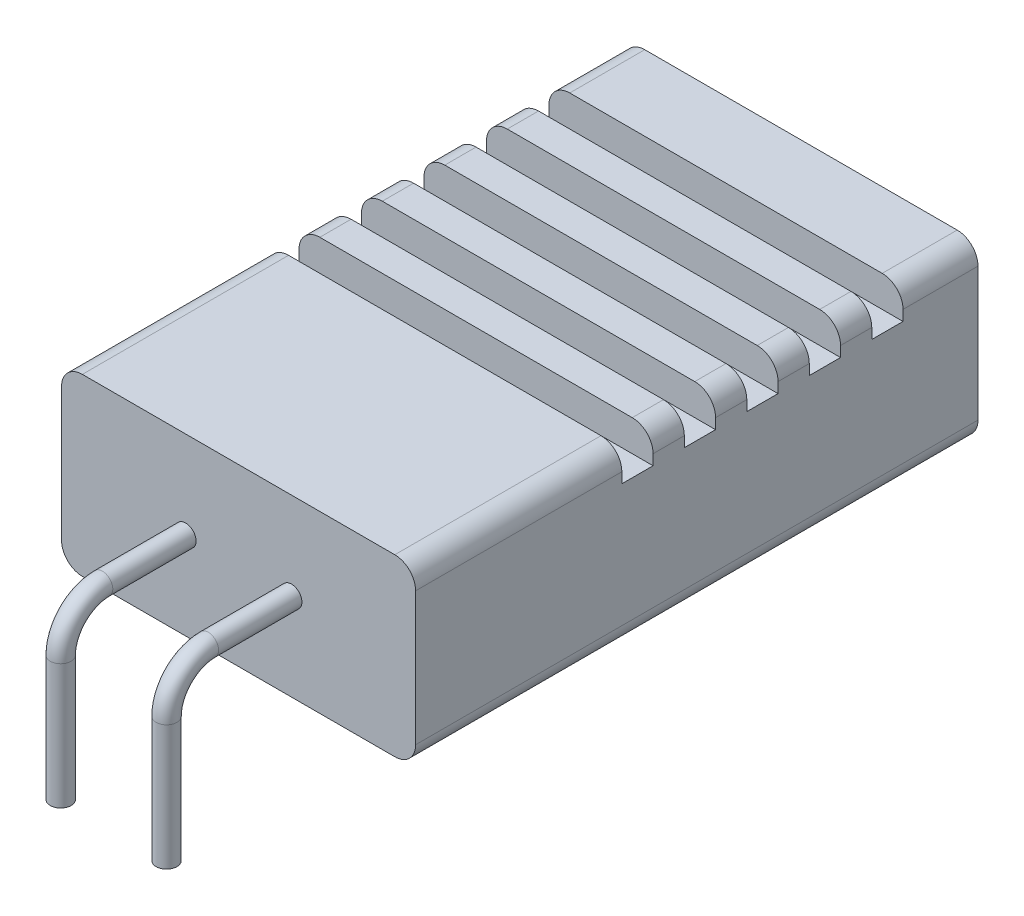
ISO-10303-21;
HEADER;
FILE_DESCRIPTION(('STEP AP214'),'2;1');
FILE_NAME('part.step','',(''),(''),'','','');
FILE_SCHEMA(('AUTOMOTIVE_DESIGN { 1 0 10303 214 1 1 1 1 }'));
ENDSEC;
DATA;
#1=APPLICATION_CONTEXT('core data for automotive mechanical design processes');
#2=APPLICATION_PROTOCOL_DEFINITION('international standard','automotive_design',2000,#1);
#3=PRODUCT_CONTEXT('',#1,'mechanical');
#4=PRODUCT('Part','Part','',(#3));
#5=PRODUCT_RELATED_PRODUCT_CATEGORY('part','',(#4));
#6=PRODUCT_DEFINITION_FORMATION('','',#4);
#7=PRODUCT_DEFINITION_CONTEXT('part definition',#1,'design');
#8=PRODUCT_DEFINITION('design','',#6,#7);
#9=PRODUCT_DEFINITION_SHAPE('','',#8);
#10=(LENGTH_UNIT() NAMED_UNIT(*) SI_UNIT(.MILLI.,.METRE.));
#11=(NAMED_UNIT(*) PLANE_ANGLE_UNIT() SI_UNIT($,.RADIAN.));
#12=(NAMED_UNIT(*) SI_UNIT($,.STERADIAN.) SOLID_ANGLE_UNIT());
#13=UNCERTAINTY_MEASURE_WITH_UNIT(LENGTH_MEASURE(1.E-05),#10,'distance_accuracy_value','');
#14=(GEOMETRIC_REPRESENTATION_CONTEXT(3) GLOBAL_UNCERTAINTY_ASSIGNED_CONTEXT((#13)) GLOBAL_UNIT_ASSIGNED_CONTEXT((#10,
#11,#12)) REPRESENTATION_CONTEXT('',''));
#15=CARTESIAN_POINT('',(0.,0.,0.));
#16=DIRECTION('',(0.,0.,1.));
#17=DIRECTION('',(1.,0.,0.));
#18=AXIS2_PLACEMENT_3D('',#15,#16,#17);
#19=CARTESIAN_POINT('',(0.,4.2,0.));
#20=DIRECTION('',(0.,0.,-1.));
#21=DIRECTION('',(-1.,0.,0.));
#22=AXIS2_PLACEMENT_3D('',#19,#20,#21);
#23=PLANE('',#22);
#24=CARTESIAN_POINT('',(5.52,2.1,0.));
#25=DIRECTION('',(0.,0.,1.));
#26=DIRECTION('',(1.,0.,0.));
#27=AXIS2_PLACEMENT_3D('',#24,#25,#26);
#28=CIRCLE('',#27,0.25);
#29=CARTESIAN_POINT('',(5.77,2.1,0.));
#30=VERTEX_POINT('',#29);
#31=EDGE_CURVE('E40',#30,#30,#28,.T.);
#32=ORIENTED_EDGE('',*,*,#31,.F.);
#33=EDGE_LOOP('',(#32));
#34=FACE_BOUND('',#33,.T.);
#35=DIRECTION('',(1.,0.,0.));
#36=VECTOR('',#35,1.);
#37=CARTESIAN_POINT('',(0.,0.,0.));
#38=LINE('',#37,#36);
#39=CARTESIAN_POINT('',(0.5,0.,0.));
#40=VERTEX_POINT('',#39);
#41=CARTESIAN_POINT('',(8.,0.,0.));
#42=VERTEX_POINT('',#41);
#43=EDGE_CURVE('E422',#40,#42,#38,.T.);
#44=ORIENTED_EDGE('',*,*,#43,.T.);
#45=CARTESIAN_POINT('',(8.,0.5,0.));
#46=DIRECTION('',(0.,0.,-1.));
#47=DIRECTION('',(-1.,0.,0.));
#48=AXIS2_PLACEMENT_3D('',#45,#46,#47);
#49=CIRCLE('',#48,0.5);
#50=CARTESIAN_POINT('',(8.5,0.5,0.));
#51=VERTEX_POINT('',#50);
#52=EDGE_CURVE('E484',#42,#51,#49,.F.);
#53=ORIENTED_EDGE('',*,*,#52,.T.);
#54=DIRECTION('',(0.,-1.,0.));
#55=VECTOR('',#54,1.);
#56=CARTESIAN_POINT('',(8.5,4.2,0.));
#57=LINE('',#56,#55);
#58=CARTESIAN_POINT('',(8.5,3.7,0.));
#59=VERTEX_POINT('',#58);
#60=EDGE_CURVE('E447',#59,#51,#57,.T.);
#61=ORIENTED_EDGE('',*,*,#60,.F.);
#62=CARTESIAN_POINT('',(8.,3.7,0.));
#63=DIRECTION('',(0.,0.,-1.));
#64=DIRECTION('',(-1.,0.,0.));
#65=AXIS2_PLACEMENT_3D('',#62,#63,#64);
#66=CIRCLE('',#65,0.5);
#67=CARTESIAN_POINT('',(8.,4.2,0.));
#68=VERTEX_POINT('',#67);
#69=EDGE_CURVE('E480',#59,#68,#66,.F.);
#70=ORIENTED_EDGE('',*,*,#69,.T.);
#71=DIRECTION('',(1.,0.,0.));
#72=VECTOR('',#71,1.);
#73=CARTESIAN_POINT('',(0.,4.2,0.));
#74=LINE('',#73,#72);
#75=CARTESIAN_POINT('',(0.5,4.2,0.));
#76=VERTEX_POINT('',#75);
#77=EDGE_CURVE('E430',#76,#68,#74,.T.);
#78=ORIENTED_EDGE('',*,*,#77,.F.);
#79=CARTESIAN_POINT('',(0.5,3.7,0.));
#80=DIRECTION('',(0.,0.,-1.));
#81=DIRECTION('',(-1.,0.,0.));
#82=AXIS2_PLACEMENT_3D('',#79,#80,#81);
#83=CIRCLE('',#82,0.5);
#84=CARTESIAN_POINT('',(0.,3.7,0.));
#85=VERTEX_POINT('',#84);
#86=EDGE_CURVE('E478',#76,#85,#83,.F.);
#87=ORIENTED_EDGE('',*,*,#86,.T.);
#88=DIRECTION('',(0.,-1.,0.));
#89=VECTOR('',#88,1.);
#90=CARTESIAN_POINT('',(0.,4.2,0.));
#91=LINE('',#90,#89);
#92=CARTESIAN_POINT('',(0.,0.5,0.));
#93=VERTEX_POINT('',#92);
#94=EDGE_CURVE('E449',#85,#93,#91,.T.);
#95=ORIENTED_EDGE('',*,*,#94,.T.);
#96=CARTESIAN_POINT('',(0.5,0.5,0.));
#97=DIRECTION('',(0.,0.,-1.));
#98=DIRECTION('',(-1.,0.,0.));
#99=AXIS2_PLACEMENT_3D('',#96,#97,#98);
#100=CIRCLE('',#99,0.5);
#101=EDGE_CURVE('E482',#93,#40,#100,.F.);
#102=ORIENTED_EDGE('',*,*,#101,.T.);
#103=EDGE_LOOP('',(#44,#53,#61,#70,#78,#87,#95,#102));
#104=FACE_BOUND('',#103,.T.);
#105=CARTESIAN_POINT('',(2.98,2.1,0.));
#106=DIRECTION('',(0.,0.,1.));
#107=DIRECTION('',(-1.,0.,0.));
#108=AXIS2_PLACEMENT_3D('',#105,#106,#107);
#109=CIRCLE('',#108,0.25);
#110=CARTESIAN_POINT('',(2.73,2.1,0.));
#111=VERTEX_POINT('',#110);
#112=EDGE_CURVE('E11',#111,#111,#109,.T.);
#113=ORIENTED_EDGE('',*,*,#112,.F.);
#114=EDGE_LOOP('',(#113));
#115=FACE_BOUND('',#114,.T.);
#116=ADVANCED_FACE('F31',(#34,#104,#115),#23,.F.);
#117=CARTESIAN_POINT('',(0.,4.2,-13.5));
#118=DIRECTION('',(0.,-1.,0.));
#119=DIRECTION('',(0.,0.,-1.));
#120=AXIS2_PLACEMENT_3D('',#117,#118,#119);
#121=PLANE('',#120);
#122=DIRECTION('',(-1.,0.,0.));
#123=VECTOR('',#122,1.);
#124=CARTESIAN_POINT('',(8.5,4.2,-5.7));
#125=LINE('',#124,#123);
#126=CARTESIAN_POINT('',(8.,4.2,-5.7));
#127=VERTEX_POINT('',#126);
#128=CARTESIAN_POINT('',(0.5,4.2,-5.7));
#129=VERTEX_POINT('',#128);
#130=EDGE_CURVE('E316',#127,#129,#125,.T.);
#131=ORIENTED_EDGE('',*,*,#130,.F.);
#132=DIRECTION('',(0.,0.,-1.));
#133=VECTOR('',#132,1.);
#134=CARTESIAN_POINT('',(8.,4.2,-13.5));
#135=LINE('',#134,#133);
#136=CARTESIAN_POINT('',(8.,4.2,-6.45));
#137=VERTEX_POINT('',#136);
#138=EDGE_CURVE('E556',#127,#137,#135,.T.);
#139=ORIENTED_EDGE('',*,*,#138,.T.);
#140=DIRECTION('',(-1.,0.,0.));
#141=VECTOR('',#140,1.);
#142=CARTESIAN_POINT('',(8.5,4.2,-6.45));
#143=LINE('',#142,#141);
#144=CARTESIAN_POINT('',(0.5,4.2,-6.45));
#145=VERTEX_POINT('',#144);
#146=EDGE_CURVE('E342',#137,#145,#143,.T.);
#147=ORIENTED_EDGE('',*,*,#146,.T.);
#148=DIRECTION('',(0.,0.,1.));
#149=VECTOR('',#148,1.);
#150=CARTESIAN_POINT('',(0.5,4.2,-13.5));
#151=LINE('',#150,#149);
#152=EDGE_CURVE('E553',#145,#129,#151,.T.);
#153=ORIENTED_EDGE('',*,*,#152,.T.);
#154=EDGE_LOOP('',(#131,#139,#147,#153));
#155=FACE_BOUND('',#154,.T.);
#156=ADVANCED_FACE('F602',(#155),#121,.F.);
#157=DIRECTION('',(-1.,0.,0.));
#158=VECTOR('',#157,1.);
#159=CARTESIAN_POINT('',(8.5,4.2,-7.2));
#160=LINE('',#159,#158);
#161=CARTESIAN_POINT('',(8.,4.2,-7.2));
#162=VERTEX_POINT('',#161);
#163=CARTESIAN_POINT('',(0.5,4.2,-7.2));
#164=VERTEX_POINT('',#163);
#165=EDGE_CURVE('E338',#162,#164,#160,.T.);
#166=ORIENTED_EDGE('',*,*,#165,.F.);
#167=DIRECTION('',(0.,0.,-1.));
#168=VECTOR('',#167,1.);
#169=CARTESIAN_POINT('',(8.,4.2,-13.5));
#170=LINE('',#169,#168);
#171=CARTESIAN_POINT('',(8.,4.2,-7.95));
#172=VERTEX_POINT('',#171);
#173=EDGE_CURVE('E542',#162,#172,#170,.T.);
#174=ORIENTED_EDGE('',*,*,#173,.T.);
#175=DIRECTION('',(-1.,0.,0.));
#176=VECTOR('',#175,1.);
#177=CARTESIAN_POINT('',(8.5,4.2,-7.95));
#178=LINE('',#177,#176);
#179=CARTESIAN_POINT('',(0.5,4.2,-7.95));
#180=VERTEX_POINT('',#179);
#181=EDGE_CURVE('E369',#172,#180,#178,.T.);
#182=ORIENTED_EDGE('',*,*,#181,.T.);
#183=DIRECTION('',(0.,0.,1.));
#184=VECTOR('',#183,1.);
#185=CARTESIAN_POINT('',(0.5,4.2,-13.5));
#186=LINE('',#185,#184);
#187=EDGE_CURVE('E539',#180,#164,#186,.T.);
#188=ORIENTED_EDGE('',*,*,#187,.T.);
#189=EDGE_LOOP('',(#166,#174,#182,#188));
#190=FACE_BOUND('',#189,.T.);
#191=ADVANCED_FACE('F608',(#190),#121,.F.);
#192=DIRECTION('',(-1.,0.,0.));
#193=VECTOR('',#192,1.);
#194=CARTESIAN_POINT('',(8.5,4.2,-8.7));
#195=LINE('',#194,#193);
#196=CARTESIAN_POINT('',(8.,4.2,-8.7));
#197=VERTEX_POINT('',#196);
#198=CARTESIAN_POINT('',(0.5,4.2,-8.7));
#199=VERTEX_POINT('',#198);
#200=EDGE_CURVE('E365',#197,#199,#195,.T.);
#201=ORIENTED_EDGE('',*,*,#200,.F.);
#202=DIRECTION('',(0.,0.,-1.));
#203=VECTOR('',#202,1.);
#204=CARTESIAN_POINT('',(8.,4.2,-13.5));
#205=LINE('',#204,#203);
#206=CARTESIAN_POINT('',(8.,4.2,-9.45));
#207=VERTEX_POINT('',#206);
#208=EDGE_CURVE('E528',#197,#207,#205,.T.);
#209=ORIENTED_EDGE('',*,*,#208,.T.);
#210=DIRECTION('',(-1.,0.,0.));
#211=VECTOR('',#210,1.);
#212=CARTESIAN_POINT('',(8.5,4.2,-9.45));
#213=LINE('',#212,#211);
#214=CARTESIAN_POINT('',(0.5,4.2,-9.45));
#215=VERTEX_POINT('',#214);
#216=EDGE_CURVE('E396',#207,#215,#213,.T.);
#217=ORIENTED_EDGE('',*,*,#216,.T.);
#218=DIRECTION('',(0.,0.,1.));
#219=VECTOR('',#218,1.);
#220=CARTESIAN_POINT('',(0.5,4.2,-13.5));
#221=LINE('',#220,#219);
#222=EDGE_CURVE('E525',#215,#199,#221,.T.);
#223=ORIENTED_EDGE('',*,*,#222,.T.);
#224=EDGE_LOOP('',(#201,#209,#217,#223));
#225=FACE_BOUND('',#224,.T.);
#226=ADVANCED_FACE('F713',(#225),#121,.F.);
#227=DIRECTION('',(-1.,0.,0.));
#228=VECTOR('',#227,1.);
#229=CARTESIAN_POINT('',(8.5,4.2,-10.2));
#230=LINE('',#229,#228);
#231=CARTESIAN_POINT('',(8.,4.2,-10.2));
#232=VERTEX_POINT('',#231);
#233=CARTESIAN_POINT('',(0.5,4.2,-10.2));
#234=VERTEX_POINT('',#233);
#235=EDGE_CURVE('E392',#232,#234,#230,.T.);
#236=ORIENTED_EDGE('',*,*,#235,.F.);
#237=DIRECTION('',(0.,0.,-1.));
#238=VECTOR('',#237,1.);
#239=CARTESIAN_POINT('',(8.,4.2,-13.5));
#240=LINE('',#239,#238);
#241=CARTESIAN_POINT('',(8.,4.2,-10.95));
#242=VERTEX_POINT('',#241);
#243=EDGE_CURVE('E514',#232,#242,#240,.T.);
#244=ORIENTED_EDGE('',*,*,#243,.T.);
#245=DIRECTION('',(-1.,0.,0.));
#246=VECTOR('',#245,1.);
#247=CARTESIAN_POINT('',(8.5,4.2,-10.95));
#248=LINE('',#247,#246);
#249=CARTESIAN_POINT('',(0.5,4.2,-10.95));
#250=VERTEX_POINT('',#249);
#251=EDGE_CURVE('E423',#242,#250,#248,.T.);
#252=ORIENTED_EDGE('',*,*,#251,.T.);
#253=DIRECTION('',(0.,0.,1.));
#254=VECTOR('',#253,1.);
#255=CARTESIAN_POINT('',(0.5,4.2,-13.5));
#256=LINE('',#255,#254);
#257=EDGE_CURVE('E511',#250,#234,#256,.T.);
#258=ORIENTED_EDGE('',*,*,#257,.T.);
#259=EDGE_LOOP('',(#236,#244,#252,#258));
#260=FACE_BOUND('',#259,.T.);
#261=ADVANCED_FACE('F680',(#260),#121,.F.);
#262=DIRECTION('',(-1.,0.,0.));
#263=VECTOR('',#262,1.);
#264=CARTESIAN_POINT('',(8.5,4.2,-11.7));
#265=LINE('',#264,#263);
#266=CARTESIAN_POINT('',(8.,4.2,-11.7));
#267=VERTEX_POINT('',#266);
#268=CARTESIAN_POINT('',(0.5,4.2,-11.7));
#269=VERTEX_POINT('',#268);
#270=EDGE_CURVE('E419',#267,#269,#265,.T.);
#271=ORIENTED_EDGE('',*,*,#270,.F.);
#272=DIRECTION('',(0.,0.,-1.));
#273=VECTOR('',#272,1.);
#274=CARTESIAN_POINT('',(8.,4.2,-13.5));
#275=LINE('',#274,#273);
#276=CARTESIAN_POINT('',(8.,4.2,-13.5));
#277=VERTEX_POINT('',#276);
#278=EDGE_CURVE('E504',#267,#277,#275,.T.);
#279=ORIENTED_EDGE('',*,*,#278,.T.);
#280=DIRECTION('',(-1.,0.,0.));
#281=VECTOR('',#280,1.);
#282=CARTESIAN_POINT('',(0.,4.2,-13.5));
#283=LINE('',#282,#281);
#284=CARTESIAN_POINT('',(0.5,4.2,-13.5));
#285=VERTEX_POINT('',#284);
#286=EDGE_CURVE('E433',#277,#285,#283,.T.);
#287=ORIENTED_EDGE('',*,*,#286,.T.);
#288=DIRECTION('',(0.,0.,1.));
#289=VECTOR('',#288,1.);
#290=CARTESIAN_POINT('',(0.5,4.2,-13.5));
#291=LINE('',#290,#289);
#292=EDGE_CURVE('E501',#285,#269,#291,.T.);
#293=ORIENTED_EDGE('',*,*,#292,.T.);
#294=EDGE_LOOP('',(#271,#279,#287,#293));
#295=FACE_BOUND('',#294,.T.);
#296=ADVANCED_FACE('F619',(#295),#121,.F.);
#297=CARTESIAN_POINT('',(0.,4.2,0.));
#298=DIRECTION('',(1.,0.,0.));
#299=DIRECTION('',(0.,0.,-1.));
#300=AXIS2_PLACEMENT_3D('',#297,#298,#299);
#301=PLANE('',#300);
#302=DIRECTION('',(0.,-1.,0.));
#303=VECTOR('',#302,1.);
#304=CARTESIAN_POINT('',(0.,4.2,-13.5));
#305=LINE('',#304,#303);
#306=CARTESIAN_POINT('',(0.,3.7,-13.5));
#307=VERTEX_POINT('',#306);
#308=CARTESIAN_POINT('',(0.,0.5,-13.5));
#309=VERTEX_POINT('',#308);
#310=EDGE_CURVE('E437',#307,#309,#305,.T.);
#311=ORIENTED_EDGE('',*,*,#310,.T.);
#312=DIRECTION('',(0.,0.,1.));
#313=VECTOR('',#312,1.);
#314=CARTESIAN_POINT('',(0.,0.5,0.));
#315=LINE('',#314,#313);
#316=EDGE_CURVE('E498',#309,#93,#315,.T.);
#317=ORIENTED_EDGE('',*,*,#316,.T.);
#318=ORIENTED_EDGE('',*,*,#94,.F.);
#319=DIRECTION('',(0.,0.,1.));
#320=VECTOR('',#319,1.);
#321=CARTESIAN_POINT('',(0.,3.7,0.));
#322=LINE('',#321,#320);
#323=CARTESIAN_POINT('',(0.,3.7,-4.95));
#324=VERTEX_POINT('',#323);
#325=EDGE_CURVE('E496',#85,#324,#322,.F.);
#326=ORIENTED_EDGE('',*,*,#325,.T.);
#327=DIRECTION('',(0.,1.,0.));
#328=VECTOR('',#327,1.);
#329=CARTESIAN_POINT('',(0.,3.45,-4.95));
#330=LINE('',#329,#328);
#331=CARTESIAN_POINT('',(0.,3.45,-4.95));
#332=VERTEX_POINT('',#331);
#333=EDGE_CURVE('E292',#332,#324,#330,.T.);
#334=ORIENTED_EDGE('',*,*,#333,.F.);
#335=DIRECTION('',(0.,0.,1.));
#336=VECTOR('',#335,1.);
#337=CARTESIAN_POINT('',(0.,3.45,-5.7));
#338=LINE('',#337,#336);
#339=CARTESIAN_POINT('',(0.,3.45,-5.7));
#340=VERTEX_POINT('',#339);
#341=EDGE_CURVE('E312',#340,#332,#338,.T.);
#342=ORIENTED_EDGE('',*,*,#341,.F.);
#343=DIRECTION('',(0.,-1.,0.));
#344=VECTOR('',#343,1.);
#345=CARTESIAN_POINT('',(0.,3.45,-5.7));
#346=LINE('',#345,#344);
#347=CARTESIAN_POINT('',(0.,3.7,-5.7));
#348=VERTEX_POINT('',#347);
#349=EDGE_CURVE('E298',#348,#340,#346,.T.);
#350=ORIENTED_EDGE('',*,*,#349,.F.);
#351=DIRECTION('',(0.,0.,1.));
#352=VECTOR('',#351,1.);
#353=CARTESIAN_POINT('',(0.,3.7,0.));
#354=LINE('',#353,#352);
#355=CARTESIAN_POINT('',(0.,3.7,-6.45));
#356=VERTEX_POINT('',#355);
#357=EDGE_CURVE('E494',#348,#356,#354,.F.);
#358=ORIENTED_EDGE('',*,*,#357,.T.);
#359=DIRECTION('',(0.,1.,0.));
#360=VECTOR('',#359,1.);
#361=CARTESIAN_POINT('',(0.,3.45,-6.45));
#362=LINE('',#361,#360);
#363=CARTESIAN_POINT('',(0.,3.45,-6.45));
#364=VERTEX_POINT('',#363);
#365=EDGE_CURVE('E326',#364,#356,#362,.T.);
#366=ORIENTED_EDGE('',*,*,#365,.F.);
#367=DIRECTION('',(0.,0.,1.));
#368=VECTOR('',#367,1.);
#369=CARTESIAN_POINT('',(0.,3.45,-7.2));
#370=LINE('',#369,#368);
#371=CARTESIAN_POINT('',(0.,3.45,-7.2));
#372=VERTEX_POINT('',#371);
#373=EDGE_CURVE('E333',#372,#364,#370,.T.);
#374=ORIENTED_EDGE('',*,*,#373,.F.);
#375=DIRECTION('',(0.,-1.,0.));
#376=VECTOR('',#375,1.);
#377=CARTESIAN_POINT('',(0.,3.45,-7.2));
#378=LINE('',#377,#376);
#379=CARTESIAN_POINT('',(0.,3.7,-7.2));
#380=VERTEX_POINT('',#379);
#381=EDGE_CURVE('E319',#380,#372,#378,.T.);
#382=ORIENTED_EDGE('',*,*,#381,.F.);
#383=DIRECTION('',(0.,0.,1.));
#384=VECTOR('',#383,1.);
#385=CARTESIAN_POINT('',(0.,3.7,0.));
#386=LINE('',#385,#384);
#387=CARTESIAN_POINT('',(0.,3.7,-7.95));
#388=VERTEX_POINT('',#387);
#389=EDGE_CURVE('E492',#380,#388,#386,.F.);
#390=ORIENTED_EDGE('',*,*,#389,.T.);
#391=DIRECTION('',(0.,1.,0.));
#392=VECTOR('',#391,1.);
#393=CARTESIAN_POINT('',(0.,3.45,-7.95));
#394=LINE('',#393,#392);
#395=CARTESIAN_POINT('',(0.,3.45,-7.95));
#396=VERTEX_POINT('',#395);
#397=EDGE_CURVE('E352',#396,#388,#394,.T.);
#398=ORIENTED_EDGE('',*,*,#397,.F.);
#399=DIRECTION('',(0.,0.,1.));
#400=VECTOR('',#399,1.);
#401=CARTESIAN_POINT('',(0.,3.45,-8.7));
#402=LINE('',#401,#400);
#403=CARTESIAN_POINT('',(0.,3.45,-8.7));
#404=VERTEX_POINT('',#403);
#405=EDGE_CURVE('E360',#404,#396,#402,.T.);
#406=ORIENTED_EDGE('',*,*,#405,.F.);
#407=DIRECTION('',(0.,-1.,0.));
#408=VECTOR('',#407,1.);
#409=CARTESIAN_POINT('',(0.,3.45,-8.7));
#410=LINE('',#409,#408);
#411=CARTESIAN_POINT('',(0.,3.7,-8.7));
#412=VERTEX_POINT('',#411);
#413=EDGE_CURVE('E341',#412,#404,#410,.T.);
#414=ORIENTED_EDGE('',*,*,#413,.F.);
#415=DIRECTION('',(0.,0.,1.));
#416=VECTOR('',#415,1.);
#417=CARTESIAN_POINT('',(0.,3.7,0.));
#418=LINE('',#417,#416);
#419=CARTESIAN_POINT('',(0.,3.7,-9.45));
#420=VERTEX_POINT('',#419);
#421=EDGE_CURVE('E490',#412,#420,#418,.F.);
#422=ORIENTED_EDGE('',*,*,#421,.T.);
#423=DIRECTION('',(0.,1.,0.));
#424=VECTOR('',#423,1.);
#425=CARTESIAN_POINT('',(0.,3.45,-9.45));
#426=LINE('',#425,#424);
#427=CARTESIAN_POINT('',(0.,3.45,-9.45));
#428=VERTEX_POINT('',#427);
#429=EDGE_CURVE('E379',#428,#420,#426,.T.);
#430=ORIENTED_EDGE('',*,*,#429,.F.);
#431=DIRECTION('',(0.,0.,1.));
#432=VECTOR('',#431,1.);
#433=CARTESIAN_POINT('',(0.,3.45,-10.2));
#434=LINE('',#433,#432);
#435=CARTESIAN_POINT('',(0.,3.45,-10.2));
#436=VERTEX_POINT('',#435);
#437=EDGE_CURVE('E387',#436,#428,#434,.T.);
#438=ORIENTED_EDGE('',*,*,#437,.F.);
#439=DIRECTION('',(0.,-1.,0.));
#440=VECTOR('',#439,1.);
#441=CARTESIAN_POINT('',(0.,3.45,-10.2));
#442=LINE('',#441,#440);
#443=CARTESIAN_POINT('',(0.,3.7,-10.2));
#444=VERTEX_POINT('',#443);
#445=EDGE_CURVE('E368',#444,#436,#442,.T.);
#446=ORIENTED_EDGE('',*,*,#445,.F.);
#447=DIRECTION('',(0.,0.,1.));
#448=VECTOR('',#447,1.);
#449=CARTESIAN_POINT('',(0.,3.7,0.));
#450=LINE('',#449,#448);
#451=CARTESIAN_POINT('',(0.,3.7,-10.95));
#452=VERTEX_POINT('',#451);
#453=EDGE_CURVE('E488',#444,#452,#450,.F.);
#454=ORIENTED_EDGE('',*,*,#453,.T.);
#455=DIRECTION('',(0.,1.,0.));
#456=VECTOR('',#455,1.);
#457=CARTESIAN_POINT('',(0.,3.45,-10.95));
#458=LINE('',#457,#456);
#459=CARTESIAN_POINT('',(0.,3.45,-10.95));
#460=VERTEX_POINT('',#459);
#461=EDGE_CURVE('E406',#460,#452,#458,.T.);
#462=ORIENTED_EDGE('',*,*,#461,.F.);
#463=DIRECTION('',(0.,0.,1.));
#464=VECTOR('',#463,1.);
#465=CARTESIAN_POINT('',(0.,3.45,-11.7));
#466=LINE('',#465,#464);
#467=CARTESIAN_POINT('',(0.,3.45,-11.7));
#468=VERTEX_POINT('',#467);
#469=EDGE_CURVE('E414',#468,#460,#466,.T.);
#470=ORIENTED_EDGE('',*,*,#469,.F.);
#471=DIRECTION('',(0.,-1.,0.));
#472=VECTOR('',#471,1.);
#473=CARTESIAN_POINT('',(0.,3.45,-11.7));
#474=LINE('',#473,#472);
#475=CARTESIAN_POINT('',(0.,3.7,-11.7));
#476=VERTEX_POINT('',#475);
#477=EDGE_CURVE('E395',#476,#468,#474,.T.);
#478=ORIENTED_EDGE('',*,*,#477,.F.);
#479=DIRECTION('',(0.,0.,1.));
#480=VECTOR('',#479,1.);
#481=CARTESIAN_POINT('',(0.,3.7,0.));
#482=LINE('',#481,#480);
#483=EDGE_CURVE('E486',#476,#307,#482,.F.);
#484=ORIENTED_EDGE('',*,*,#483,.T.);
#485=EDGE_LOOP('',(#311,#317,#318,#326,#334,#342,#350,#358,#366,#374,#382,#390,#398,#406,#414,
#422,#430,#438,#446,#454,#462,#470,#478,#484));
#486=FACE_BOUND('',#485,.T.);
#487=ADVANCED_FACE('F616',(#486),#301,.F.);
#488=CARTESIAN_POINT('',(8.5,4.2,0.));
#489=DIRECTION('',(-1.,0.,0.));
#490=DIRECTION('',(0.,0.,1.));
#491=AXIS2_PLACEMENT_3D('',#488,#489,#490);
#492=PLANE('',#491);
#493=ORIENTED_EDGE('',*,*,#60,.T.);
#494=DIRECTION('',(0.,0.,-1.));
#495=VECTOR('',#494,1.);
#496=CARTESIAN_POINT('',(8.5,0.5,-13.5));
#497=LINE('',#496,#495);
#498=CARTESIAN_POINT('',(8.5,0.5,-13.5));
#499=VERTEX_POINT('',#498);
#500=EDGE_CURVE('E463',#51,#499,#497,.T.);
#501=ORIENTED_EDGE('',*,*,#500,.T.);
#502=DIRECTION('',(0.,-1.,0.));
#503=VECTOR('',#502,1.);
#504=CARTESIAN_POINT('',(8.5,4.2,-13.5));
#505=LINE('',#504,#503);
#506=CARTESIAN_POINT('',(8.5,3.7,-13.5));
#507=VERTEX_POINT('',#506);
#508=EDGE_CURVE('E444',#507,#499,#505,.T.);
#509=ORIENTED_EDGE('',*,*,#508,.F.);
#510=DIRECTION('',(0.,0.,-1.));
#511=VECTOR('',#510,1.);
#512=CARTESIAN_POINT('',(8.5,3.7,0.));
#513=LINE('',#512,#511);
#514=CARTESIAN_POINT('',(8.5,3.7,-11.7));
#515=VERTEX_POINT('',#514);
#516=EDGE_CURVE('E461',#507,#515,#513,.F.);
#517=ORIENTED_EDGE('',*,*,#516,.T.);
#518=DIRECTION('',(0.,-1.,0.));
#519=VECTOR('',#518,1.);
#520=CARTESIAN_POINT('',(8.5,3.45,-11.7));
#521=LINE('',#520,#519);
#522=CARTESIAN_POINT('',(8.5,3.45,-11.7));
#523=VERTEX_POINT('',#522);
#524=EDGE_CURVE('E403',#515,#523,#521,.T.);
#525=ORIENTED_EDGE('',*,*,#524,.T.);
#526=DIRECTION('',(0.,0.,1.));
#527=VECTOR('',#526,1.);
#528=CARTESIAN_POINT('',(8.5,3.45,-11.7));
#529=LINE('',#528,#527);
#530=CARTESIAN_POINT('',(8.5,3.45,-10.95));
#531=VERTEX_POINT('',#530);
#532=EDGE_CURVE('E405',#523,#531,#529,.T.);
#533=ORIENTED_EDGE('',*,*,#532,.T.);
#534=DIRECTION('',(0.,1.,0.));
#535=VECTOR('',#534,1.);
#536=CARTESIAN_POINT('',(8.5,3.45,-10.95));
#537=LINE('',#536,#535);
#538=CARTESIAN_POINT('',(8.5,3.7,-10.95));
#539=VERTEX_POINT('',#538);
#540=EDGE_CURVE('E409',#531,#539,#537,.T.);
#541=ORIENTED_EDGE('',*,*,#540,.T.);
#542=DIRECTION('',(0.,0.,-1.));
#543=VECTOR('',#542,1.);
#544=CARTESIAN_POINT('',(8.5,3.7,0.));
#545=LINE('',#544,#543);
#546=CARTESIAN_POINT('',(8.5,3.7,-10.2));
#547=VERTEX_POINT('',#546);
#548=EDGE_CURVE('E459',#539,#547,#545,.F.);
#549=ORIENTED_EDGE('',*,*,#548,.T.);
#550=DIRECTION('',(0.,-1.,0.));
#551=VECTOR('',#550,1.);
#552=CARTESIAN_POINT('',(8.5,3.45,-10.2));
#553=LINE('',#552,#551);
#554=CARTESIAN_POINT('',(8.5,3.45,-10.2));
#555=VERTEX_POINT('',#554);
#556=EDGE_CURVE('E376',#547,#555,#553,.T.);
#557=ORIENTED_EDGE('',*,*,#556,.T.);
#558=DIRECTION('',(0.,0.,1.));
#559=VECTOR('',#558,1.);
#560=CARTESIAN_POINT('',(8.5,3.45,-10.2));
#561=LINE('',#560,#559);
#562=CARTESIAN_POINT('',(8.5,3.45,-9.45));
#563=VERTEX_POINT('',#562);
#564=EDGE_CURVE('E378',#555,#563,#561,.T.);
#565=ORIENTED_EDGE('',*,*,#564,.T.);
#566=DIRECTION('',(0.,1.,0.));
#567=VECTOR('',#566,1.);
#568=CARTESIAN_POINT('',(8.5,3.45,-9.45));
#569=LINE('',#568,#567);
#570=CARTESIAN_POINT('',(8.5,3.7,-9.45));
#571=VERTEX_POINT('',#570);
#572=EDGE_CURVE('E382',#563,#571,#569,.T.);
#573=ORIENTED_EDGE('',*,*,#572,.T.);
#574=DIRECTION('',(0.,0.,-1.));
#575=VECTOR('',#574,1.);
#576=CARTESIAN_POINT('',(8.5,3.7,0.));
#577=LINE('',#576,#575);
#578=CARTESIAN_POINT('',(8.5,3.7,-8.7));
#579=VERTEX_POINT('',#578);
#580=EDGE_CURVE('E457',#571,#579,#577,.F.);
#581=ORIENTED_EDGE('',*,*,#580,.T.);
#582=DIRECTION('',(0.,-1.,0.));
#583=VECTOR('',#582,1.);
#584=CARTESIAN_POINT('',(8.5,3.45,-8.7));
#585=LINE('',#584,#583);
#586=CARTESIAN_POINT('',(8.5,3.45,-8.7));
#587=VERTEX_POINT('',#586);
#588=EDGE_CURVE('E349',#579,#587,#585,.T.);
#589=ORIENTED_EDGE('',*,*,#588,.T.);
#590=DIRECTION('',(0.,0.,1.));
#591=VECTOR('',#590,1.);
#592=CARTESIAN_POINT('',(8.5,3.45,-8.7));
#593=LINE('',#592,#591);
#594=CARTESIAN_POINT('',(8.5,3.45,-7.95));
#595=VERTEX_POINT('',#594);
#596=EDGE_CURVE('E351',#587,#595,#593,.T.);
#597=ORIENTED_EDGE('',*,*,#596,.T.);
#598=DIRECTION('',(0.,1.,0.));
#599=VECTOR('',#598,1.);
#600=CARTESIAN_POINT('',(8.5,3.45,-7.95));
#601=LINE('',#600,#599);
#602=CARTESIAN_POINT('',(8.5,3.7,-7.95));
#603=VERTEX_POINT('',#602);
#604=EDGE_CURVE('E355',#595,#603,#601,.T.);
#605=ORIENTED_EDGE('',*,*,#604,.T.);
#606=DIRECTION('',(0.,0.,-1.));
#607=VECTOR('',#606,1.);
#608=CARTESIAN_POINT('',(8.5,3.7,0.));
#609=LINE('',#608,#607);
#610=CARTESIAN_POINT('',(8.5,3.7,-7.2));
#611=VERTEX_POINT('',#610);
#612=EDGE_CURVE('E455',#603,#611,#609,.F.);
#613=ORIENTED_EDGE('',*,*,#612,.T.);
#614=DIRECTION('',(0.,-1.,0.));
#615=VECTOR('',#614,1.);
#616=CARTESIAN_POINT('',(8.5,3.45,-7.2));
#617=LINE('',#616,#615);
#618=CARTESIAN_POINT('',(8.5,3.45,-7.2));
#619=VERTEX_POINT('',#618);
#620=EDGE_CURVE('E323',#611,#619,#617,.T.);
#621=ORIENTED_EDGE('',*,*,#620,.T.);
#622=DIRECTION('',(0.,0.,1.));
#623=VECTOR('',#622,1.);
#624=CARTESIAN_POINT('',(8.5,3.45,-7.2));
#625=LINE('',#624,#623);
#626=CARTESIAN_POINT('',(8.5,3.45,-6.45));
#627=VERTEX_POINT('',#626);
#628=EDGE_CURVE('E325',#619,#627,#625,.T.);
#629=ORIENTED_EDGE('',*,*,#628,.T.);
#630=DIRECTION('',(0.,1.,0.));
#631=VECTOR('',#630,1.);
#632=CARTESIAN_POINT('',(8.5,3.45,-6.45));
#633=LINE('',#632,#631);
#634=CARTESIAN_POINT('',(8.5,3.7,-6.45));
#635=VERTEX_POINT('',#634);
#636=EDGE_CURVE('E329',#627,#635,#633,.T.);
#637=ORIENTED_EDGE('',*,*,#636,.T.);
#638=DIRECTION('',(0.,0.,-1.));
#639=VECTOR('',#638,1.);
#640=CARTESIAN_POINT('',(8.5,3.7,0.));
#641=LINE('',#640,#639);
#642=CARTESIAN_POINT('',(8.5,3.7,-5.7));
#643=VERTEX_POINT('',#642);
#644=EDGE_CURVE('E289',#635,#643,#641,.F.);
#645=ORIENTED_EDGE('',*,*,#644,.T.);
#646=DIRECTION('',(0.,-1.,0.));
#647=VECTOR('',#646,1.);
#648=CARTESIAN_POINT('',(8.5,3.45,-5.7));
#649=LINE('',#648,#647);
#650=CARTESIAN_POINT('',(8.5,3.45,-5.7));
#651=VERTEX_POINT('',#650);
#652=EDGE_CURVE('E280',#643,#651,#649,.T.);
#653=ORIENTED_EDGE('',*,*,#652,.T.);
#654=DIRECTION('',(0.,0.,1.));
#655=VECTOR('',#654,1.);
#656=CARTESIAN_POINT('',(8.5,3.45,-5.7));
#657=LINE('',#656,#655);
#658=CARTESIAN_POINT('',(8.5,3.45,-4.95));
#659=VERTEX_POINT('',#658);
#660=EDGE_CURVE('E286',#651,#659,#657,.T.);
#661=ORIENTED_EDGE('',*,*,#660,.T.);
#662=DIRECTION('',(0.,1.,0.));
#663=VECTOR('',#662,1.);
#664=CARTESIAN_POINT('',(8.5,3.45,-4.95));
#665=LINE('',#664,#663);
#666=CARTESIAN_POINT('',(8.5,3.7,-4.95));
#667=VERTEX_POINT('',#666);
#668=EDGE_CURVE('E303',#659,#667,#665,.T.);
#669=ORIENTED_EDGE('',*,*,#668,.T.);
#670=DIRECTION('',(0.,0.,-1.));
#671=VECTOR('',#670,1.);
#672=CARTESIAN_POINT('',(8.5,3.7,0.));
#673=LINE('',#672,#671);
#674=EDGE_CURVE('E452',#667,#59,#673,.F.);
#675=ORIENTED_EDGE('',*,*,#674,.T.);
#676=EDGE_LOOP('',(#493,#501,#509,#517,#525,#533,#541,#549,#557,#565,#573,#581,#589,#597,#605,
#613,#621,#629,#637,#645,#653,#661,#669,#675));
#677=FACE_BOUND('',#676,.T.);
#678=ADVANCED_FACE('F283',(#677),#492,.F.);
#679=CARTESIAN_POINT('',(0.,4.2,-13.5));
#680=DIRECTION('',(0.,0.,1.));
#681=DIRECTION('',(1.,0.,0.));
#682=AXIS2_PLACEMENT_3D('',#679,#680,#681);
#683=PLANE('',#682);
#684=ORIENTED_EDGE('',*,*,#508,.T.);
#685=CARTESIAN_POINT('',(8.,0.5,-13.5));
#686=DIRECTION('',(0.,0.,1.));
#687=DIRECTION('',(1.,0.,0.));
#688=AXIS2_PLACEMENT_3D('',#685,#686,#687);
#689=CIRCLE('',#688,0.5);
#690=CARTESIAN_POINT('',(8.,0.,-13.5));
#691=VERTEX_POINT('',#690);
#692=EDGE_CURVE('E472',#499,#691,#689,.F.);
#693=ORIENTED_EDGE('',*,*,#692,.T.);
#694=DIRECTION('',(-1.,0.,0.));
#695=VECTOR('',#694,1.);
#696=CARTESIAN_POINT('',(0.,0.,-13.5));
#697=LINE('',#696,#695);
#698=CARTESIAN_POINT('',(0.5,0.,-13.5));
#699=VERTEX_POINT('',#698);
#700=EDGE_CURVE('E434',#691,#699,#697,.T.);
#701=ORIENTED_EDGE('',*,*,#700,.T.);
#702=CARTESIAN_POINT('',(0.5,0.5,-13.5));
#703=DIRECTION('',(0.,0.,1.));
#704=DIRECTION('',(1.,0.,0.));
#705=AXIS2_PLACEMENT_3D('',#702,#703,#704);
#706=CIRCLE('',#705,0.5);
#707=EDGE_CURVE('E470',#699,#309,#706,.F.);
#708=ORIENTED_EDGE('',*,*,#707,.T.);
#709=ORIENTED_EDGE('',*,*,#310,.F.);
#710=CARTESIAN_POINT('',(0.5,3.7,-13.5));
#711=DIRECTION('',(0.,0.,1.));
#712=DIRECTION('',(1.,0.,0.));
#713=AXIS2_PLACEMENT_3D('',#710,#711,#712);
#714=CIRCLE('',#713,0.5);
#715=EDGE_CURVE('E466',#307,#285,#714,.F.);
#716=ORIENTED_EDGE('',*,*,#715,.T.);
#717=ORIENTED_EDGE('',*,*,#286,.F.);
#718=CARTESIAN_POINT('',(8.,3.7,-13.5));
#719=DIRECTION('',(0.,0.,1.));
#720=DIRECTION('',(1.,0.,0.));
#721=AXIS2_PLACEMENT_3D('',#718,#719,#720);
#722=CIRCLE('',#721,0.5);
#723=EDGE_CURVE('E468',#277,#507,#722,.F.);
#724=ORIENTED_EDGE('',*,*,#723,.T.);
#725=EDGE_LOOP('',(#684,#693,#701,#708,#709,#716,#717,#724));
#726=FACE_BOUND('',#725,.T.);
#727=ADVANCED_FACE('F769',(#726),#683,.F.);
#728=ORIENTED_EDGE('',*,*,#77,.T.);
#729=DIRECTION('',(0.,0.,-1.));
#730=VECTOR('',#729,1.);
#731=CARTESIAN_POINT('',(8.,4.2,-13.5));
#732=LINE('',#731,#730);
#733=CARTESIAN_POINT('',(8.,4.2,-4.95));
#734=VERTEX_POINT('',#733);
#735=EDGE_CURVE('E570',#68,#734,#732,.T.);
#736=ORIENTED_EDGE('',*,*,#735,.T.);
#737=DIRECTION('',(-1.,0.,0.));
#738=VECTOR('',#737,1.);
#739=CARTESIAN_POINT('',(8.5,4.2,-4.95));
#740=LINE('',#739,#738);
#741=CARTESIAN_POINT('',(0.5,4.2,-4.95));
#742=VERTEX_POINT('',#741);
#743=EDGE_CURVE('E320',#734,#742,#740,.T.);
#744=ORIENTED_EDGE('',*,*,#743,.T.);
#745=DIRECTION('',(0.,0.,1.));
#746=VECTOR('',#745,1.);
#747=CARTESIAN_POINT('',(0.5,4.2,-13.5));
#748=LINE('',#747,#746);
#749=EDGE_CURVE('E567',#742,#76,#748,.T.);
#750=ORIENTED_EDGE('',*,*,#749,.T.);
#751=EDGE_LOOP('',(#728,#736,#744,#750));
#752=FACE_BOUND('',#751,.T.);
#753=ADVANCED_FACE('F611',(#752),#121,.F.);
#754=CARTESIAN_POINT('',(0.,0.,-13.5));
#755=DIRECTION('',(0.,-1.,0.));
#756=DIRECTION('',(0.,0.,-1.));
#757=AXIS2_PLACEMENT_3D('',#754,#755,#756);
#758=PLANE('',#757);
#759=ORIENTED_EDGE('',*,*,#700,.F.);
#760=DIRECTION('',(0.,0.,-1.));
#761=VECTOR('',#760,1.);
#762=CARTESIAN_POINT('',(8.,0.,0.));
#763=LINE('',#762,#761);
#764=EDGE_CURVE('E476',#691,#42,#763,.F.);
#765=ORIENTED_EDGE('',*,*,#764,.T.);
#766=ORIENTED_EDGE('',*,*,#43,.F.);
#767=DIRECTION('',(0.,0.,1.));
#768=VECTOR('',#767,1.);
#769=CARTESIAN_POINT('',(0.5,0.,-13.5));
#770=LINE('',#769,#768);
#771=EDGE_CURVE('E474',#40,#699,#770,.F.);
#772=ORIENTED_EDGE('',*,*,#771,.T.);
#773=EDGE_LOOP('',(#759,#765,#766,#772));
#774=FACE_BOUND('',#773,.T.);
#775=ADVANCED_FACE('F772',(#774),#758,.T.);
#776=CARTESIAN_POINT('',(8.5,3.45,-11.7));
#777=DIRECTION('',(0.,0.,-1.));
#778=DIRECTION('',(-1.,0.,0.));
#779=AXIS2_PLACEMENT_3D('',#776,#777,#778);
#780=PLANE('',#779);
#781=ORIENTED_EDGE('',*,*,#524,.F.);
#782=CARTESIAN_POINT('',(8.,3.7,-11.7));
#783=DIRECTION('',(0.,0.,-1.));
#784=DIRECTION('',(-1.,0.,0.));
#785=AXIS2_PLACEMENT_3D('',#782,#783,#784);
#786=CIRCLE('',#785,0.5);
#787=EDGE_CURVE('E509',#515,#267,#786,.F.);
#788=ORIENTED_EDGE('',*,*,#787,.T.);
#789=ORIENTED_EDGE('',*,*,#270,.T.);
#790=CARTESIAN_POINT('',(0.5,3.7,-11.7));
#791=DIRECTION('',(0.,0.,-1.));
#792=DIRECTION('',(-1.,0.,0.));
#793=AXIS2_PLACEMENT_3D('',#790,#791,#792);
#794=CIRCLE('',#793,0.5);
#795=EDGE_CURVE('E507',#269,#476,#794,.F.);
#796=ORIENTED_EDGE('',*,*,#795,.T.);
#797=ORIENTED_EDGE('',*,*,#477,.T.);
#798=DIRECTION('',(-1.,0.,0.));
#799=VECTOR('',#798,1.);
#800=CARTESIAN_POINT('',(8.5,3.45,-11.7));
#801=LINE('',#800,#799);
#802=EDGE_CURVE('E412',#523,#468,#801,.T.);
#803=ORIENTED_EDGE('',*,*,#802,.F.);
#804=EDGE_LOOP('',(#781,#788,#789,#796,#797,#803));
#805=FACE_BOUND('',#804,.T.);
#806=ADVANCED_FACE('F787',(#805),#780,.F.);
#807=CARTESIAN_POINT('',(8.5,3.45,-10.95));
#808=DIRECTION('',(0.,0.,1.));
#809=DIRECTION('',(1.,0.,0.));
#810=AXIS2_PLACEMENT_3D('',#807,#808,#809);
#811=PLANE('',#810);
#812=ORIENTED_EDGE('',*,*,#251,.F.);
#813=CARTESIAN_POINT('',(8.,3.7,-10.95));
#814=DIRECTION('',(0.,0.,1.));
#815=DIRECTION('',(1.,0.,0.));
#816=AXIS2_PLACEMENT_3D('',#813,#814,#815);
#817=CIRCLE('',#816,0.5);
#818=EDGE_CURVE('E519',#242,#539,#817,.F.);
#819=ORIENTED_EDGE('',*,*,#818,.T.);
#820=ORIENTED_EDGE('',*,*,#540,.F.);
#821=DIRECTION('',(-1.,0.,0.));
#822=VECTOR('',#821,1.);
#823=CARTESIAN_POINT('',(8.5,3.45,-10.95));
#824=LINE('',#823,#822);
#825=EDGE_CURVE('E426',#531,#460,#824,.T.);
#826=ORIENTED_EDGE('',*,*,#825,.T.);
#827=ORIENTED_EDGE('',*,*,#461,.T.);
#828=CARTESIAN_POINT('',(0.5,3.7,-10.95));
#829=DIRECTION('',(0.,0.,1.));
#830=DIRECTION('',(1.,0.,0.));
#831=AXIS2_PLACEMENT_3D('',#828,#829,#830);
#832=CIRCLE('',#831,0.5);
#833=EDGE_CURVE('E517',#452,#250,#832,.F.);
#834=ORIENTED_EDGE('',*,*,#833,.T.);
#835=EDGE_LOOP('',(#812,#819,#820,#826,#827,#834));
#836=FACE_BOUND('',#835,.T.);
#837=ADVANCED_FACE('F676',(#836),#811,.F.);
#838=CARTESIAN_POINT('',(8.5,3.45,-11.7));
#839=DIRECTION('',(0.,-1.,0.));
#840=DIRECTION('',(0.,0.,-1.));
#841=AXIS2_PLACEMENT_3D('',#838,#839,#840);
#842=PLANE('',#841);
#843=ORIENTED_EDGE('',*,*,#469,.T.);
#844=ORIENTED_EDGE('',*,*,#825,.F.);
#845=ORIENTED_EDGE('',*,*,#532,.F.);
#846=ORIENTED_EDGE('',*,*,#802,.T.);
#847=EDGE_LOOP('',(#843,#844,#845,#846));
#848=FACE_BOUND('',#847,.T.);
#849=ADVANCED_FACE('F690',(#848),#842,.F.);
#850=CARTESIAN_POINT('',(8.5,3.45,-10.2));
#851=DIRECTION('',(0.,0.,-1.));
#852=DIRECTION('',(-1.,0.,0.));
#853=AXIS2_PLACEMENT_3D('',#850,#851,#852);
#854=PLANE('',#853);
#855=ORIENTED_EDGE('',*,*,#556,.F.);
#856=CARTESIAN_POINT('',(8.,3.7,-10.2));
#857=DIRECTION('',(0.,0.,-1.));
#858=DIRECTION('',(-1.,0.,0.));
#859=AXIS2_PLACEMENT_3D('',#856,#857,#858);
#860=CIRCLE('',#859,0.5);
#861=EDGE_CURVE('E523',#547,#232,#860,.F.);
#862=ORIENTED_EDGE('',*,*,#861,.T.);
#863=ORIENTED_EDGE('',*,*,#235,.T.);
#864=CARTESIAN_POINT('',(0.5,3.7,-10.2));
#865=DIRECTION('',(0.,0.,-1.));
#866=DIRECTION('',(-1.,0.,0.));
#867=AXIS2_PLACEMENT_3D('',#864,#865,#866);
#868=CIRCLE('',#867,0.5);
#869=EDGE_CURVE('E521',#234,#444,#868,.F.);
#870=ORIENTED_EDGE('',*,*,#869,.T.);
#871=ORIENTED_EDGE('',*,*,#445,.T.);
#872=DIRECTION('',(-1.,0.,0.));
#873=VECTOR('',#872,1.);
#874=CARTESIAN_POINT('',(8.5,3.45,-10.2));
#875=LINE('',#874,#873);
#876=EDGE_CURVE('E385',#555,#436,#875,.T.);
#877=ORIENTED_EDGE('',*,*,#876,.F.);
#878=EDGE_LOOP('',(#855,#862,#863,#870,#871,#877));
#879=FACE_BOUND('',#878,.T.);
#880=ADVANCED_FACE('F698',(#879),#854,.F.);
#881=CARTESIAN_POINT('',(8.5,3.45,-9.45));
#882=DIRECTION('',(0.,0.,1.));
#883=DIRECTION('',(1.,0.,0.));
#884=AXIS2_PLACEMENT_3D('',#881,#882,#883);
#885=PLANE('',#884);
#886=ORIENTED_EDGE('',*,*,#216,.F.);
#887=CARTESIAN_POINT('',(8.,3.7,-9.45));
#888=DIRECTION('',(0.,0.,1.));
#889=DIRECTION('',(1.,0.,0.));
#890=AXIS2_PLACEMENT_3D('',#887,#888,#889);
#891=CIRCLE('',#890,0.5);
#892=EDGE_CURVE('E533',#207,#571,#891,.F.);
#893=ORIENTED_EDGE('',*,*,#892,.T.);
#894=ORIENTED_EDGE('',*,*,#572,.F.);
#895=DIRECTION('',(-1.,0.,0.));
#896=VECTOR('',#895,1.);
#897=CARTESIAN_POINT('',(8.5,3.45,-9.45));
#898=LINE('',#897,#896);
#899=EDGE_CURVE('E399',#563,#428,#898,.T.);
#900=ORIENTED_EDGE('',*,*,#899,.T.);
#901=ORIENTED_EDGE('',*,*,#429,.T.);
#902=CARTESIAN_POINT('',(0.5,3.7,-9.45));
#903=DIRECTION('',(0.,0.,1.));
#904=DIRECTION('',(1.,0.,0.));
#905=AXIS2_PLACEMENT_3D('',#902,#903,#904);
#906=CIRCLE('',#905,0.5);
#907=EDGE_CURVE('E531',#420,#215,#906,.F.);
#908=ORIENTED_EDGE('',*,*,#907,.T.);
#909=EDGE_LOOP('',(#886,#893,#894,#900,#901,#908));
#910=FACE_BOUND('',#909,.T.);
#911=ADVANCED_FACE('F879',(#910),#885,.F.);
#912=CARTESIAN_POINT('',(8.5,3.45,-10.2));
#913=DIRECTION('',(0.,-1.,0.));
#914=DIRECTION('',(0.,0.,-1.));
#915=AXIS2_PLACEMENT_3D('',#912,#913,#914);
#916=PLANE('',#915);
#917=ORIENTED_EDGE('',*,*,#437,.T.);
#918=ORIENTED_EDGE('',*,*,#899,.F.);
#919=ORIENTED_EDGE('',*,*,#564,.F.);
#920=ORIENTED_EDGE('',*,*,#876,.T.);
#921=EDGE_LOOP('',(#917,#918,#919,#920));
#922=FACE_BOUND('',#921,.T.);
#923=ADVANCED_FACE('F701',(#922),#916,.F.);
#924=CARTESIAN_POINT('',(8.5,3.45,-8.7));
#925=DIRECTION('',(0.,0.,-1.));
#926=DIRECTION('',(-1.,0.,0.));
#927=AXIS2_PLACEMENT_3D('',#924,#925,#926);
#928=PLANE('',#927);
#929=ORIENTED_EDGE('',*,*,#588,.F.);
#930=CARTESIAN_POINT('',(8.,3.7,-8.7));
#931=DIRECTION('',(0.,0.,-1.));
#932=DIRECTION('',(-1.,0.,0.));
#933=AXIS2_PLACEMENT_3D('',#930,#931,#932);
#934=CIRCLE('',#933,0.5);
#935=EDGE_CURVE('E537',#579,#197,#934,.F.);
#936=ORIENTED_EDGE('',*,*,#935,.T.);
#937=ORIENTED_EDGE('',*,*,#200,.T.);
#938=CARTESIAN_POINT('',(0.5,3.7,-8.7));
#939=DIRECTION('',(0.,0.,-1.));
#940=DIRECTION('',(-1.,0.,0.));
#941=AXIS2_PLACEMENT_3D('',#938,#939,#940);
#942=CIRCLE('',#941,0.5);
#943=EDGE_CURVE('E535',#199,#412,#942,.F.);
#944=ORIENTED_EDGE('',*,*,#943,.T.);
#945=ORIENTED_EDGE('',*,*,#413,.T.);
#946=DIRECTION('',(-1.,0.,0.));
#947=VECTOR('',#946,1.);
#948=CARTESIAN_POINT('',(8.5,3.45,-8.7));
#949=LINE('',#948,#947);
#950=EDGE_CURVE('E358',#587,#404,#949,.T.);
#951=ORIENTED_EDGE('',*,*,#950,.F.);
#952=EDGE_LOOP('',(#929,#936,#937,#944,#945,#951));
#953=FACE_BOUND('',#952,.T.);
#954=ADVANCED_FACE('F710',(#953),#928,.F.);
#955=CARTESIAN_POINT('',(8.5,3.45,-7.95));
#956=DIRECTION('',(0.,0.,1.));
#957=DIRECTION('',(1.,0.,0.));
#958=AXIS2_PLACEMENT_3D('',#955,#956,#957);
#959=PLANE('',#958);
#960=ORIENTED_EDGE('',*,*,#181,.F.);
#961=CARTESIAN_POINT('',(8.,3.7,-7.95));
#962=DIRECTION('',(0.,0.,1.));
#963=DIRECTION('',(1.,0.,0.));
#964=AXIS2_PLACEMENT_3D('',#961,#962,#963);
#965=CIRCLE('',#964,0.5);
#966=EDGE_CURVE('E547',#172,#603,#965,.F.);
#967=ORIENTED_EDGE('',*,*,#966,.T.);
#968=ORIENTED_EDGE('',*,*,#604,.F.);
#969=DIRECTION('',(-1.,0.,0.));
#970=VECTOR('',#969,1.);
#971=CARTESIAN_POINT('',(8.5,3.45,-7.95));
#972=LINE('',#971,#970);
#973=EDGE_CURVE('E372',#595,#396,#972,.T.);
#974=ORIENTED_EDGE('',*,*,#973,.T.);
#975=ORIENTED_EDGE('',*,*,#397,.T.);
#976=CARTESIAN_POINT('',(0.5,3.7,-7.95));
#977=DIRECTION('',(0.,0.,1.));
#978=DIRECTION('',(1.,0.,0.));
#979=AXIS2_PLACEMENT_3D('',#976,#977,#978);
#980=CIRCLE('',#979,0.5);
#981=EDGE_CURVE('E545',#388,#180,#980,.F.);
#982=ORIENTED_EDGE('',*,*,#981,.T.);
#983=EDGE_LOOP('',(#960,#967,#968,#974,#975,#982));
#984=FACE_BOUND('',#983,.T.);
#985=ADVANCED_FACE('F866',(#984),#959,.F.);
#986=CARTESIAN_POINT('',(8.5,3.45,-8.7));
#987=DIRECTION('',(0.,-1.,0.));
#988=DIRECTION('',(0.,0.,-1.));
#989=AXIS2_PLACEMENT_3D('',#986,#987,#988);
#990=PLANE('',#989);
#991=ORIENTED_EDGE('',*,*,#405,.T.);
#992=ORIENTED_EDGE('',*,*,#973,.F.);
#993=ORIENTED_EDGE('',*,*,#596,.F.);
#994=ORIENTED_EDGE('',*,*,#950,.T.);
#995=EDGE_LOOP('',(#991,#992,#993,#994));
#996=FACE_BOUND('',#995,.T.);
#997=ADVANCED_FACE('F722',(#996),#990,.F.);
#998=CARTESIAN_POINT('',(8.5,3.45,-7.2));
#999=DIRECTION('',(0.,0.,-1.));
#1000=DIRECTION('',(-1.,0.,0.));
#1001=AXIS2_PLACEMENT_3D('',#998,#999,#1000);
#1002=PLANE('',#1001);
#1003=ORIENTED_EDGE('',*,*,#620,.F.);
#1004=CARTESIAN_POINT('',(8.,3.7,-7.2));
#1005=DIRECTION('',(0.,0.,-1.));
#1006=DIRECTION('',(-1.,0.,0.));
#1007=AXIS2_PLACEMENT_3D('',#1004,#1005,#1006);
#1008=CIRCLE('',#1007,0.5);
#1009=EDGE_CURVE('E551',#611,#162,#1008,.F.);
#1010=ORIENTED_EDGE('',*,*,#1009,.T.);
#1011=ORIENTED_EDGE('',*,*,#165,.T.);
#1012=CARTESIAN_POINT('',(0.5,3.7,-7.2));
#1013=DIRECTION('',(0.,0.,-1.));
#1014=DIRECTION('',(-1.,0.,0.));
#1015=AXIS2_PLACEMENT_3D('',#1012,#1013,#1014);
#1016=CIRCLE('',#1015,0.5);
#1017=EDGE_CURVE('E549',#164,#380,#1016,.F.);
#1018=ORIENTED_EDGE('',*,*,#1017,.T.);
#1019=ORIENTED_EDGE('',*,*,#381,.T.);
#1020=DIRECTION('',(-1.,0.,0.));
#1021=VECTOR('',#1020,1.);
#1022=CARTESIAN_POINT('',(8.5,3.45,-7.2));
#1023=LINE('',#1022,#1021);
#1024=EDGE_CURVE('E331',#619,#372,#1023,.T.);
#1025=ORIENTED_EDGE('',*,*,#1024,.F.);
#1026=EDGE_LOOP('',(#1003,#1010,#1011,#1018,#1019,#1025));
#1027=FACE_BOUND('',#1026,.T.);
#1028=ADVANCED_FACE('F732',(#1027),#1002,.F.);
#1029=CARTESIAN_POINT('',(8.5,3.45,-6.45));
#1030=DIRECTION('',(0.,0.,1.));
#1031=DIRECTION('',(1.,0.,0.));
#1032=AXIS2_PLACEMENT_3D('',#1029,#1030,#1031);
#1033=PLANE('',#1032);
#1034=ORIENTED_EDGE('',*,*,#146,.F.);
#1035=CARTESIAN_POINT('',(8.,3.7,-6.45));
#1036=DIRECTION('',(0.,0.,1.));
#1037=DIRECTION('',(1.,0.,0.));
#1038=AXIS2_PLACEMENT_3D('',#1035,#1036,#1037);
#1039=CIRCLE('',#1038,0.5);
#1040=EDGE_CURVE('E561',#137,#635,#1039,.F.);
#1041=ORIENTED_EDGE('',*,*,#1040,.T.);
#1042=ORIENTED_EDGE('',*,*,#636,.F.);
#1043=DIRECTION('',(-1.,0.,0.));
#1044=VECTOR('',#1043,1.);
#1045=CARTESIAN_POINT('',(8.5,3.45,-6.45));
#1046=LINE('',#1045,#1044);
#1047=EDGE_CURVE('E345',#627,#364,#1046,.T.);
#1048=ORIENTED_EDGE('',*,*,#1047,.T.);
#1049=ORIENTED_EDGE('',*,*,#365,.T.);
#1050=CARTESIAN_POINT('',(0.5,3.7,-6.45));
#1051=DIRECTION('',(0.,0.,1.));
#1052=DIRECTION('',(1.,0.,0.));
#1053=AXIS2_PLACEMENT_3D('',#1050,#1051,#1052);
#1054=CIRCLE('',#1053,0.5);
#1055=EDGE_CURVE('E559',#356,#145,#1054,.F.);
#1056=ORIENTED_EDGE('',*,*,#1055,.T.);
#1057=EDGE_LOOP('',(#1034,#1041,#1042,#1048,#1049,#1056));
#1058=FACE_BOUND('',#1057,.T.);
#1059=ADVANCED_FACE('F853',(#1058),#1033,.F.);
#1060=CARTESIAN_POINT('',(8.5,3.45,-7.2));
#1061=DIRECTION('',(0.,-1.,0.));
#1062=DIRECTION('',(0.,0.,-1.));
#1063=AXIS2_PLACEMENT_3D('',#1060,#1061,#1062);
#1064=PLANE('',#1063);
#1065=ORIENTED_EDGE('',*,*,#373,.T.);
#1066=ORIENTED_EDGE('',*,*,#1047,.F.);
#1067=ORIENTED_EDGE('',*,*,#628,.F.);
#1068=ORIENTED_EDGE('',*,*,#1024,.T.);
#1069=EDGE_LOOP('',(#1065,#1066,#1067,#1068));
#1070=FACE_BOUND('',#1069,.T.);
#1071=ADVANCED_FACE('F743',(#1070),#1064,.F.);
#1072=CARTESIAN_POINT('',(8.5,3.45,-5.7));
#1073=DIRECTION('',(0.,0.,-1.));
#1074=DIRECTION('',(-1.,0.,0.));
#1075=AXIS2_PLACEMENT_3D('',#1072,#1073,#1074);
#1076=PLANE('',#1075);
#1077=ORIENTED_EDGE('',*,*,#652,.F.);
#1078=CARTESIAN_POINT('',(8.,3.7,-5.7));
#1079=DIRECTION('',(0.,0.,-1.));
#1080=DIRECTION('',(-1.,0.,0.));
#1081=AXIS2_PLACEMENT_3D('',#1078,#1079,#1080);
#1082=CIRCLE('',#1081,0.5);
#1083=EDGE_CURVE('E565',#643,#127,#1082,.F.);
#1084=ORIENTED_EDGE('',*,*,#1083,.T.);
#1085=ORIENTED_EDGE('',*,*,#130,.T.);
#1086=CARTESIAN_POINT('',(0.5,3.7,-5.7));
#1087=DIRECTION('',(0.,0.,-1.));
#1088=DIRECTION('',(-1.,0.,0.));
#1089=AXIS2_PLACEMENT_3D('',#1086,#1087,#1088);
#1090=CIRCLE('',#1089,0.5);
#1091=EDGE_CURVE('E563',#129,#348,#1090,.F.);
#1092=ORIENTED_EDGE('',*,*,#1091,.T.);
#1093=ORIENTED_EDGE('',*,*,#349,.T.);
#1094=DIRECTION('',(-1.,0.,0.));
#1095=VECTOR('',#1094,1.);
#1096=CARTESIAN_POINT('',(8.5,3.45,-5.7));
#1097=LINE('',#1096,#1095);
#1098=EDGE_CURVE('E295',#651,#340,#1097,.T.);
#1099=ORIENTED_EDGE('',*,*,#1098,.F.);
#1100=EDGE_LOOP('',(#1077,#1084,#1085,#1092,#1093,#1099));
#1101=FACE_BOUND('',#1100,.T.);
#1102=ADVANCED_FACE('F296',(#1101),#1076,.F.);
#1103=CARTESIAN_POINT('',(8.5,3.45,-4.95));
#1104=DIRECTION('',(0.,0.,1.));
#1105=DIRECTION('',(1.,0.,0.));
#1106=AXIS2_PLACEMENT_3D('',#1103,#1104,#1105);
#1107=PLANE('',#1106);
#1108=ORIENTED_EDGE('',*,*,#743,.F.);
#1109=CARTESIAN_POINT('',(8.,3.7,-4.95));
#1110=DIRECTION('',(0.,0.,1.));
#1111=DIRECTION('',(1.,0.,0.));
#1112=AXIS2_PLACEMENT_3D('',#1109,#1110,#1111);
#1113=CIRCLE('',#1112,0.5);
#1114=EDGE_CURVE('E35',#734,#667,#1113,.F.);
#1115=ORIENTED_EDGE('',*,*,#1114,.T.);
#1116=ORIENTED_EDGE('',*,*,#668,.F.);
#1117=DIRECTION('',(-1.,0.,0.));
#1118=VECTOR('',#1117,1.);
#1119=CARTESIAN_POINT('',(8.5,3.45,-4.95));
#1120=LINE('',#1119,#1118);
#1121=EDGE_CURVE('E302',#659,#332,#1120,.T.);
#1122=ORIENTED_EDGE('',*,*,#1121,.T.);
#1123=ORIENTED_EDGE('',*,*,#333,.T.);
#1124=CARTESIAN_POINT('',(0.5,3.7,-4.95));
#1125=DIRECTION('',(0.,0.,1.));
#1126=DIRECTION('',(1.,0.,0.));
#1127=AXIS2_PLACEMENT_3D('',#1124,#1125,#1126);
#1128=CIRCLE('',#1127,0.5);
#1129=EDGE_CURVE('E48',#324,#742,#1128,.F.);
#1130=ORIENTED_EDGE('',*,*,#1129,.T.);
#1131=EDGE_LOOP('',(#1108,#1115,#1116,#1122,#1123,#1130));
#1132=FACE_BOUND('',#1131,.T.);
#1133=ADVANCED_FACE('F756',(#1132),#1107,.F.);
#1134=CARTESIAN_POINT('',(8.5,3.45,-5.7));
#1135=DIRECTION('',(0.,-1.,0.));
#1136=DIRECTION('',(0.,0.,-1.));
#1137=AXIS2_PLACEMENT_3D('',#1134,#1135,#1136);
#1138=PLANE('',#1137);
#1139=ORIENTED_EDGE('',*,*,#341,.T.);
#1140=ORIENTED_EDGE('',*,*,#1121,.F.);
#1141=ORIENTED_EDGE('',*,*,#660,.F.);
#1142=ORIENTED_EDGE('',*,*,#1098,.T.);
#1143=EDGE_LOOP('',(#1139,#1140,#1141,#1142));
#1144=FACE_BOUND('',#1143,.T.);
#1145=ADVANCED_FACE('F305',(#1144),#1138,.F.);
#1146=CARTESIAN_POINT('',(8.,0.5,0.));
#1147=DIRECTION('',(0.,0.,1.));
#1148=DIRECTION('',(1.,0.,0.));
#1149=AXIS2_PLACEMENT_3D('',#1146,#1147,#1148);
#1150=CYLINDRICAL_SURFACE('',#1149,0.5);
#1151=ORIENTED_EDGE('',*,*,#52,.F.);
#1152=ORIENTED_EDGE('',*,*,#764,.F.);
#1153=ORIENTED_EDGE('',*,*,#692,.F.);
#1154=ORIENTED_EDGE('',*,*,#500,.F.);
#1155=EDGE_LOOP('',(#1151,#1152,#1153,#1154));
#1156=FACE_BOUND('',#1155,.T.);
#1157=ADVANCED_FACE('F621',(#1156),#1150,.T.);
#1158=CARTESIAN_POINT('',(0.5,0.5,0.));
#1159=DIRECTION('',(0.,0.,-1.));
#1160=DIRECTION('',(-1.,0.,0.));
#1161=AXIS2_PLACEMENT_3D('',#1158,#1159,#1160);
#1162=CYLINDRICAL_SURFACE('',#1161,0.5);
#1163=ORIENTED_EDGE('',*,*,#707,.F.);
#1164=ORIENTED_EDGE('',*,*,#771,.F.);
#1165=ORIENTED_EDGE('',*,*,#101,.F.);
#1166=ORIENTED_EDGE('',*,*,#316,.F.);
#1167=EDGE_LOOP('',(#1163,#1164,#1165,#1166));
#1168=FACE_BOUND('',#1167,.T.);
#1169=ADVANCED_FACE('F624',(#1168),#1162,.T.);
#1170=CARTESIAN_POINT('',(8.,3.7,-13.5));
#1171=DIRECTION('',(0.,0.,-1.));
#1172=DIRECTION('',(-1.,0.,0.));
#1173=AXIS2_PLACEMENT_3D('',#1170,#1171,#1172);
#1174=CYLINDRICAL_SURFACE('',#1173,0.5);
#1175=ORIENTED_EDGE('',*,*,#787,.F.);
#1176=ORIENTED_EDGE('',*,*,#516,.F.);
#1177=ORIENTED_EDGE('',*,*,#723,.F.);
#1178=ORIENTED_EDGE('',*,*,#278,.F.);
#1179=EDGE_LOOP('',(#1175,#1176,#1177,#1178));
#1180=FACE_BOUND('',#1179,.T.);
#1181=ADVANCED_FACE('F628',(#1180),#1174,.T.);
#1182=CARTESIAN_POINT('',(8.,3.7,-13.5));
#1183=DIRECTION('',(0.,0.,-1.));
#1184=DIRECTION('',(-1.,0.,0.));
#1185=AXIS2_PLACEMENT_3D('',#1182,#1183,#1184);
#1186=CYLINDRICAL_SURFACE('',#1185,0.5);
#1187=ORIENTED_EDGE('',*,*,#861,.F.);
#1188=ORIENTED_EDGE('',*,*,#548,.F.);
#1189=ORIENTED_EDGE('',*,*,#818,.F.);
#1190=ORIENTED_EDGE('',*,*,#243,.F.);
#1191=EDGE_LOOP('',(#1187,#1188,#1189,#1190));
#1192=FACE_BOUND('',#1191,.T.);
#1193=ADVANCED_FACE('F632',(#1192),#1186,.T.);
#1194=CARTESIAN_POINT('',(8.,3.7,-13.5));
#1195=DIRECTION('',(0.,0.,-1.));
#1196=DIRECTION('',(-1.,0.,0.));
#1197=AXIS2_PLACEMENT_3D('',#1194,#1195,#1196);
#1198=CYLINDRICAL_SURFACE('',#1197,0.5);
#1199=ORIENTED_EDGE('',*,*,#935,.F.);
#1200=ORIENTED_EDGE('',*,*,#580,.F.);
#1201=ORIENTED_EDGE('',*,*,#892,.F.);
#1202=ORIENTED_EDGE('',*,*,#208,.F.);
#1203=EDGE_LOOP('',(#1199,#1200,#1201,#1202));
#1204=FACE_BOUND('',#1203,.T.);
#1205=ADVANCED_FACE('F636',(#1204),#1198,.T.);
#1206=CARTESIAN_POINT('',(8.,3.7,-13.5));
#1207=DIRECTION('',(0.,0.,-1.));
#1208=DIRECTION('',(-1.,0.,0.));
#1209=AXIS2_PLACEMENT_3D('',#1206,#1207,#1208);
#1210=CYLINDRICAL_SURFACE('',#1209,0.5);
#1211=ORIENTED_EDGE('',*,*,#1009,.F.);
#1212=ORIENTED_EDGE('',*,*,#612,.F.);
#1213=ORIENTED_EDGE('',*,*,#966,.F.);
#1214=ORIENTED_EDGE('',*,*,#173,.F.);
#1215=EDGE_LOOP('',(#1211,#1212,#1213,#1214));
#1216=FACE_BOUND('',#1215,.T.);
#1217=ADVANCED_FACE('F640',(#1216),#1210,.T.);
#1218=CARTESIAN_POINT('',(8.,3.7,-13.5));
#1219=DIRECTION('',(0.,0.,-1.));
#1220=DIRECTION('',(-1.,0.,0.));
#1221=AXIS2_PLACEMENT_3D('',#1218,#1219,#1220);
#1222=CYLINDRICAL_SURFACE('',#1221,0.5);
#1223=ORIENTED_EDGE('',*,*,#1083,.F.);
#1224=ORIENTED_EDGE('',*,*,#644,.F.);
#1225=ORIENTED_EDGE('',*,*,#1040,.F.);
#1226=ORIENTED_EDGE('',*,*,#138,.F.);
#1227=EDGE_LOOP('',(#1223,#1224,#1225,#1226));
#1228=FACE_BOUND('',#1227,.T.);
#1229=ADVANCED_FACE('F644',(#1228),#1222,.T.);
#1230=CARTESIAN_POINT('',(8.,3.7,-13.5));
#1231=DIRECTION('',(0.,0.,-1.));
#1232=DIRECTION('',(-1.,0.,0.));
#1233=AXIS2_PLACEMENT_3D('',#1230,#1231,#1232);
#1234=CYLINDRICAL_SURFACE('',#1233,0.5);
#1235=ORIENTED_EDGE('',*,*,#69,.F.);
#1236=ORIENTED_EDGE('',*,*,#674,.F.);
#1237=ORIENTED_EDGE('',*,*,#1114,.F.);
#1238=ORIENTED_EDGE('',*,*,#735,.F.);
#1239=EDGE_LOOP('',(#1235,#1236,#1237,#1238));
#1240=FACE_BOUND('',#1239,.T.);
#1241=ADVANCED_FACE('F648',(#1240),#1234,.T.);
#1242=CARTESIAN_POINT('',(0.5,3.7,-13.5));
#1243=DIRECTION('',(0.,0.,1.));
#1244=DIRECTION('',(1.,0.,0.));
#1245=AXIS2_PLACEMENT_3D('',#1242,#1243,#1244);
#1246=CYLINDRICAL_SURFACE('',#1245,0.5);
#1247=ORIENTED_EDGE('',*,*,#1129,.F.);
#1248=ORIENTED_EDGE('',*,*,#325,.F.);
#1249=ORIENTED_EDGE('',*,*,#86,.F.);
#1250=ORIENTED_EDGE('',*,*,#749,.F.);
#1251=EDGE_LOOP('',(#1247,#1248,#1249,#1250));
#1252=FACE_BOUND('',#1251,.T.);
#1253=ADVANCED_FACE('F652',(#1252),#1246,.T.);
#1254=CARTESIAN_POINT('',(0.5,3.7,-13.5));
#1255=DIRECTION('',(0.,0.,1.));
#1256=DIRECTION('',(1.,0.,0.));
#1257=AXIS2_PLACEMENT_3D('',#1254,#1255,#1256);
#1258=CYLINDRICAL_SURFACE('',#1257,0.5);
#1259=ORIENTED_EDGE('',*,*,#1055,.F.);
#1260=ORIENTED_EDGE('',*,*,#357,.F.);
#1261=ORIENTED_EDGE('',*,*,#1091,.F.);
#1262=ORIENTED_EDGE('',*,*,#152,.F.);
#1263=EDGE_LOOP('',(#1259,#1260,#1261,#1262));
#1264=FACE_BOUND('',#1263,.T.);
#1265=ADVANCED_FACE('F655',(#1264),#1258,.T.);
#1266=CARTESIAN_POINT('',(0.5,3.7,-13.5));
#1267=DIRECTION('',(0.,0.,1.));
#1268=DIRECTION('',(1.,0.,0.));
#1269=AXIS2_PLACEMENT_3D('',#1266,#1267,#1268);
#1270=CYLINDRICAL_SURFACE('',#1269,0.5);
#1271=ORIENTED_EDGE('',*,*,#981,.F.);
#1272=ORIENTED_EDGE('',*,*,#389,.F.);
#1273=ORIENTED_EDGE('',*,*,#1017,.F.);
#1274=ORIENTED_EDGE('',*,*,#187,.F.);
#1275=EDGE_LOOP('',(#1271,#1272,#1273,#1274));
#1276=FACE_BOUND('',#1275,.T.);
#1277=ADVANCED_FACE('F659',(#1276),#1270,.T.);
#1278=CARTESIAN_POINT('',(0.5,3.7,-13.5));
#1279=DIRECTION('',(0.,0.,1.));
#1280=DIRECTION('',(1.,0.,0.));
#1281=AXIS2_PLACEMENT_3D('',#1278,#1279,#1280);
#1282=CYLINDRICAL_SURFACE('',#1281,0.5);
#1283=ORIENTED_EDGE('',*,*,#907,.F.);
#1284=ORIENTED_EDGE('',*,*,#421,.F.);
#1285=ORIENTED_EDGE('',*,*,#943,.F.);
#1286=ORIENTED_EDGE('',*,*,#222,.F.);
#1287=EDGE_LOOP('',(#1283,#1284,#1285,#1286));
#1288=FACE_BOUND('',#1287,.T.);
#1289=ADVANCED_FACE('F663',(#1288),#1282,.T.);
#1290=CARTESIAN_POINT('',(0.5,3.7,-13.5));
#1291=DIRECTION('',(0.,0.,1.));
#1292=DIRECTION('',(1.,0.,0.));
#1293=AXIS2_PLACEMENT_3D('',#1290,#1291,#1292);
#1294=CYLINDRICAL_SURFACE('',#1293,0.5);
#1295=ORIENTED_EDGE('',*,*,#833,.F.);
#1296=ORIENTED_EDGE('',*,*,#453,.F.);
#1297=ORIENTED_EDGE('',*,*,#869,.F.);
#1298=ORIENTED_EDGE('',*,*,#257,.F.);
#1299=EDGE_LOOP('',(#1295,#1296,#1297,#1298));
#1300=FACE_BOUND('',#1299,.T.);
#1301=ADVANCED_FACE('F598',(#1300),#1294,.T.);
#1302=CARTESIAN_POINT('',(0.5,3.7,-13.5));
#1303=DIRECTION('',(0.,0.,1.));
#1304=DIRECTION('',(1.,0.,0.));
#1305=AXIS2_PLACEMENT_3D('',#1302,#1303,#1304);
#1306=CYLINDRICAL_SURFACE('',#1305,0.5);
#1307=ORIENTED_EDGE('',*,*,#715,.F.);
#1308=ORIENTED_EDGE('',*,*,#483,.F.);
#1309=ORIENTED_EDGE('',*,*,#795,.F.);
#1310=ORIENTED_EDGE('',*,*,#292,.F.);
#1311=EDGE_LOOP('',(#1307,#1308,#1309,#1310));
#1312=FACE_BOUND('',#1311,.T.);
#1313=ADVANCED_FACE('F33',(#1312),#1306,.T.);
#1314=CARTESIAN_POINT('',(5.52,1.09999999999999,3.));
#1315=DIRECTION('',(0.,-1.,0.));
#1316=DIRECTION('',(0.,0.,-1.));
#1317=AXIS2_PLACEMENT_3D('',#1314,#1315,#1316);
#1318=CYLINDRICAL_SURFACE('',#1317,0.25);
#1319=CARTESIAN_POINT('',(5.52,1.09999999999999,3.));
#1320=DIRECTION('',(0.,-1.,0.));
#1321=DIRECTION('',(1.,0.,0.));
#1322=AXIS2_PLACEMENT_3D('',#1319,#1320,#1321);
#1323=CIRCLE('',#1322,0.25);
#1324=CARTESIAN_POINT('',(5.52,1.09999999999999,3.25));
#1325=VERTEX_POINT('',#1324);
#1326=EDGE_CURVE('E579',#1325,#1325,#1323,.T.);
#1327=ORIENTED_EDGE('',*,*,#1326,.T.);
#1328=EDGE_LOOP('',(#1327));
#1329=FACE_BOUND('',#1328,.T.);
#1330=CARTESIAN_POINT('',(5.52,-1.9,3.));
#1331=DIRECTION('',(0.,-1.,0.));
#1332=DIRECTION('',(1.,0.,0.));
#1333=AXIS2_PLACEMENT_3D('',#1330,#1331,#1332);
#1334=CIRCLE('',#1333,0.25);
#1335=CARTESIAN_POINT('',(5.77,-1.9,3.));
#1336=VERTEX_POINT('',#1335);
#1337=EDGE_CURVE('E313',#1336,#1336,#1334,.T.);
#1338=ORIENTED_EDGE('',*,*,#1337,.F.);
#1339=EDGE_LOOP('',(#1338));
#1340=FACE_BOUND('',#1339,.T.);
#1341=ADVANCED_FACE('F586',(#1329,#1340),#1318,.T.);
#1342=CARTESIAN_POINT('',(5.52,1.1,2.));
#1343=DIRECTION('',(1.,0.,0.));
#1344=DIRECTION('',(0.,0.,-1.));
#1345=AXIS2_PLACEMENT_3D('',#1342,#1343,#1344);
#1346=TOROIDAL_SURFACE('',#1345,1.,0.25);
#1347=CARTESIAN_POINT('',(5.52,2.1,1.99999999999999));
#1348=DIRECTION('',(0.,0.,1.));
#1349=DIRECTION('',(1.,0.,0.));
#1350=AXIS2_PLACEMENT_3D('',#1347,#1348,#1349);
#1351=CIRCLE('',#1350,0.25);
#1352=CARTESIAN_POINT('',(5.52,2.35,1.99999999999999));
#1353=VERTEX_POINT('',#1352);
#1354=EDGE_CURVE('E577',#1353,#1353,#1351,.T.);
#1355=CARTESIAN_POINT('',(5.52,1.1,2.));
#1356=DIRECTION('',(1.,0.,0.));
#1357=DIRECTION('',(0.,0.,-1.));
#1358=AXIS2_PLACEMENT_3D('',#1355,#1356,#1357);
#1359=CIRCLE('',#1358,1.25);
#1360=EDGE_CURVE('',#1353,#1325,#1359,.T.);
#1361=ORIENTED_EDGE('',*,*,#1354,.T.);
#1362=ORIENTED_EDGE('',*,*,#1326,.F.);
#1363=ORIENTED_EDGE('',*,*,#1360,.T.);
#1364=ORIENTED_EDGE('',*,*,#1360,.F.);
#1365=EDGE_LOOP('',(#1361,#1363,#1362,#1364));
#1366=FACE_BOUND('',#1365,.T.);
#1367=ADVANCED_FACE('F588',(#1366),#1346,.T.);
#1368=CARTESIAN_POINT('',(5.52,2.1,1.99999999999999));
#1369=DIRECTION('',(0.,0.,-1.));
#1370=DIRECTION('',(-1.,0.,0.));
#1371=AXIS2_PLACEMENT_3D('',#1368,#1369,#1370);
#1372=CYLINDRICAL_SURFACE('',#1371,0.25);
#1373=ORIENTED_EDGE('',*,*,#1354,.F.);
#1374=EDGE_LOOP('',(#1373));
#1375=FACE_BOUND('',#1374,.T.);
#1376=ORIENTED_EDGE('',*,*,#31,.T.);
#1377=EDGE_LOOP('',(#1376));
#1378=FACE_BOUND('',#1377,.T.);
#1379=ADVANCED_FACE('F595',(#1375,#1378),#1372,.T.);
#1380=CARTESIAN_POINT('',(5.52,-1.9,3.));
#1381=DIRECTION('',(0.,-1.,0.));
#1382=DIRECTION('',(1.,0.,0.));
#1383=AXIS2_PLACEMENT_3D('',#1380,#1381,#1382);
#1384=PLANE('',#1383);
#1385=ORIENTED_EDGE('',*,*,#1337,.T.);
#1386=EDGE_LOOP('',(#1385));
#1387=FACE_BOUND('',#1386,.T.);
#1388=ADVANCED_FACE('F584',(#1387),#1384,.T.);
#1389=CARTESIAN_POINT('',(2.98,1.09999999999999,3.));
#1390=DIRECTION('',(0.,-1.,0.));
#1391=DIRECTION('',(0.,0.,-1.));
#1392=AXIS2_PLACEMENT_3D('',#1389,#1390,#1391);
#1393=CYLINDRICAL_SURFACE('',#1392,0.25);
#1394=CARTESIAN_POINT('',(2.98,1.09999999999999,3.));
#1395=DIRECTION('',(0.,-1.,0.));
#1396=DIRECTION('',(-1.,0.,0.));
#1397=AXIS2_PLACEMENT_3D('',#1394,#1395,#1396);
#1398=CIRCLE('',#1397,0.25);
#1399=CARTESIAN_POINT('',(2.98,1.09999999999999,3.25));
#1400=VERTEX_POINT('',#1399);
#1401=EDGE_CURVE('E1100',#1400,#1400,#1398,.T.);
#1402=ORIENTED_EDGE('',*,*,#1401,.T.);
#1403=EDGE_LOOP('',(#1402));
#1404=FACE_BOUND('',#1403,.T.);
#1405=CARTESIAN_POINT('',(2.98,-1.9,3.));
#1406=DIRECTION('',(0.,-1.,0.));
#1407=DIRECTION('',(-1.,0.,0.));
#1408=AXIS2_PLACEMENT_3D('',#1405,#1406,#1407);
#1409=CIRCLE('',#1408,0.25);
#1410=CARTESIAN_POINT('',(2.73,-1.9,3.));
#1411=VERTEX_POINT('',#1410);
#1412=EDGE_CURVE('E1098',#1411,#1411,#1409,.T.);
#1413=ORIENTED_EDGE('',*,*,#1412,.F.);
#1414=EDGE_LOOP('',(#1413));
#1415=FACE_BOUND('',#1414,.T.);
#1416=ADVANCED_FACE('F1053',(#1404,#1415),#1393,.T.);
#1417=CARTESIAN_POINT('',(2.98,1.1,2.));
#1418=DIRECTION('',(1.,0.,0.));
#1419=DIRECTION('',(0.,0.,-1.));
#1420=AXIS2_PLACEMENT_3D('',#1417,#1418,#1419);
#1421=TOROIDAL_SURFACE('',#1420,1.,0.25);
#1422=CARTESIAN_POINT('',(2.98,2.1,1.99999999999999));
#1423=DIRECTION('',(0.,0.,1.));
#1424=DIRECTION('',(-1.,0.,0.));
#1425=AXIS2_PLACEMENT_3D('',#1422,#1423,#1424);
#1426=CIRCLE('',#1425,0.25);
#1427=CARTESIAN_POINT('',(2.98,2.35,1.99999999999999));
#1428=VERTEX_POINT('',#1427);
#1429=EDGE_CURVE('E1103',#1428,#1428,#1426,.T.);
#1430=CARTESIAN_POINT('',(2.98,1.1,2.));
#1431=DIRECTION('',(1.,0.,0.));
#1432=DIRECTION('',(0.,0.,-1.));
#1433=AXIS2_PLACEMENT_3D('',#1430,#1431,#1432);
#1434=CIRCLE('',#1433,1.25);
#1435=EDGE_CURVE('',#1428,#1400,#1434,.T.);
#1436=ORIENTED_EDGE('',*,*,#1429,.T.);
#1437=ORIENTED_EDGE('',*,*,#1401,.F.);
#1438=ORIENTED_EDGE('',*,*,#1435,.T.);
#1439=ORIENTED_EDGE('',*,*,#1435,.F.);
#1440=EDGE_LOOP('',(#1436,#1438,#1437,#1439));
#1441=FACE_BOUND('',#1440,.T.);
#1442=ADVANCED_FACE('F1062',(#1441),#1421,.T.);
#1443=CARTESIAN_POINT('',(2.98,2.1,1.99999999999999));
#1444=DIRECTION('',(0.,0.,-1.));
#1445=DIRECTION('',(-1.,0.,0.));
#1446=AXIS2_PLACEMENT_3D('',#1443,#1444,#1445);
#1447=CYLINDRICAL_SURFACE('',#1446,0.25);
#1448=ORIENTED_EDGE('',*,*,#1429,.F.);
#1449=EDGE_LOOP('',(#1448));
#1450=FACE_BOUND('',#1449,.T.);
#1451=ORIENTED_EDGE('',*,*,#112,.T.);
#1452=EDGE_LOOP('',(#1451));
#1453=FACE_BOUND('',#1452,.T.);
#1454=ADVANCED_FACE('F1072',(#1450,#1453),#1447,.T.);
#1455=CARTESIAN_POINT('',(2.98,-1.9,3.));
#1456=DIRECTION('',(0.,1.,0.));
#1457=DIRECTION('',(-1.,0.,0.));
#1458=AXIS2_PLACEMENT_3D('',#1455,#1456,#1457);
#1459=PLANE('',#1458);
#1460=ORIENTED_EDGE('',*,*,#1412,.T.);
#1461=EDGE_LOOP('',(#1460));
#1462=FACE_BOUND('',#1461,.T.);
#1463=ADVANCED_FACE('F1082',(#1462),#1459,.F.);
#1464=CLOSED_SHELL('',(#116,#156,#191,#226,#261,#296,#487,#678,#727,#753,#775,#806,#837,#849,
#880,#911,#923,#954,#985,#997,#1028,#1059,#1071,#1102,#1133,#1145,#1157,#1169,#1181,#1193,#1205,
#1217,#1229,#1241,#1253,#1265,#1277,#1289,#1301,#1313,#1341,#1367,#1379,#1388,#1416,#1442,#1454,#1463));
#1465=MANIFOLD_SOLID_BREP('B2',#1464);
#1466=ADVANCED_BREP_SHAPE_REPRESENTATION('',(#18,#1465),#14);
#1467=SHAPE_DEFINITION_REPRESENTATION(#9,#1466);
ENDSEC;
END-ISO-10303-21;
